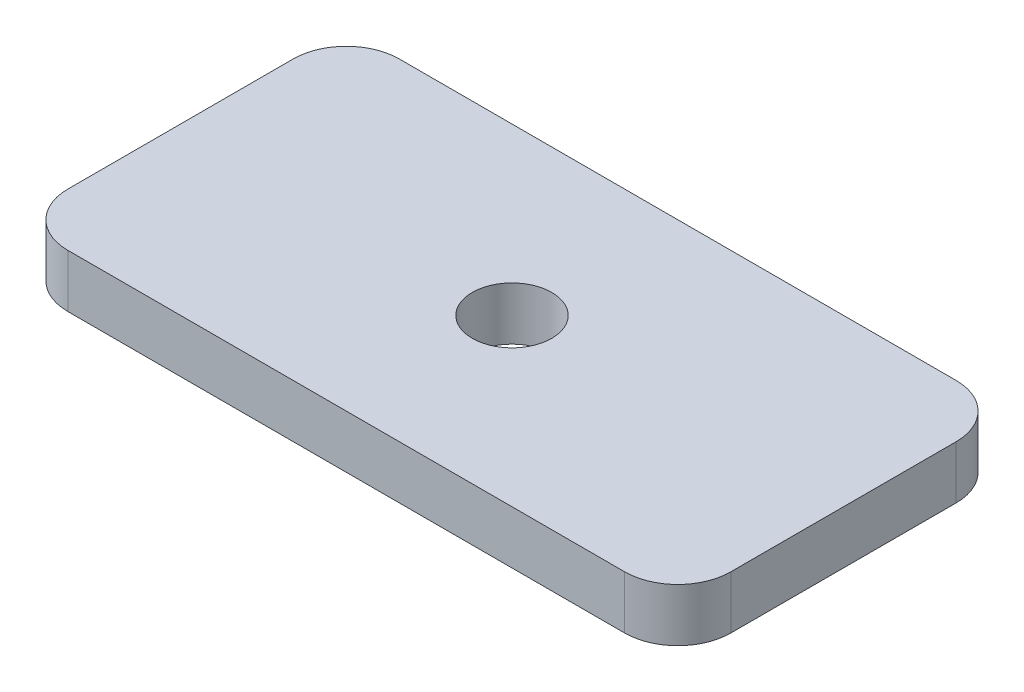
from build123d import *

# Parameters (mm, degrees)
BOSS_EXTRU_1_DEPTH      = 8
ESQUISSE2_R             = 6
ENL_V_MAT_EXTRU_1_DEPTH = 57.471231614


with BuildPart() as part:
    # Esquisse1 → Boss.-Extru.1 (new body)
    with BuildSketch(Plane(origin=(0, 0, 0), x_dir=(1, 0, 0), z_dir=(0, 1, 0))):
        with BuildLine():
            Line((-42, 25), (42, 25))
            ThreePointArc((42, 25), (47.656854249, 22.656854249), (50, 17))
            Line((50, 17), (50, -17))
            ThreePointArc((50, -17), (47.656854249, -22.656854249), (42, -25))
            Line((42, -25), (-42, -25))
            ThreePointArc((-42, -25), (-47.656854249, -22.656854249), (-50, -17))
            Line((-50, -17), (-50, 17))
            ThreePointArc((-50, 17), (-47.656854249, 22.656854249), (-42, 25))
        make_face()
    extrude(amount=BOSS_EXTRU_1_DEPTH)

    # Esquisse2 → Enl_v. mat.-Extru.1 (cut, through all)
    with BuildSketch(Plane(origin=(0, 8, 0), x_dir=(1, 0, 0), z_dir=(0, 1, 0))):
        with Locations(Location((0, 0, 0), (0, 0, 270))):
            Circle(ESQUISSE2_R)
    extrude(amount=-ENL_V_MAT_EXTRU_1_DEPTH, mode=Mode.SUBTRACT)


solid = part.part
